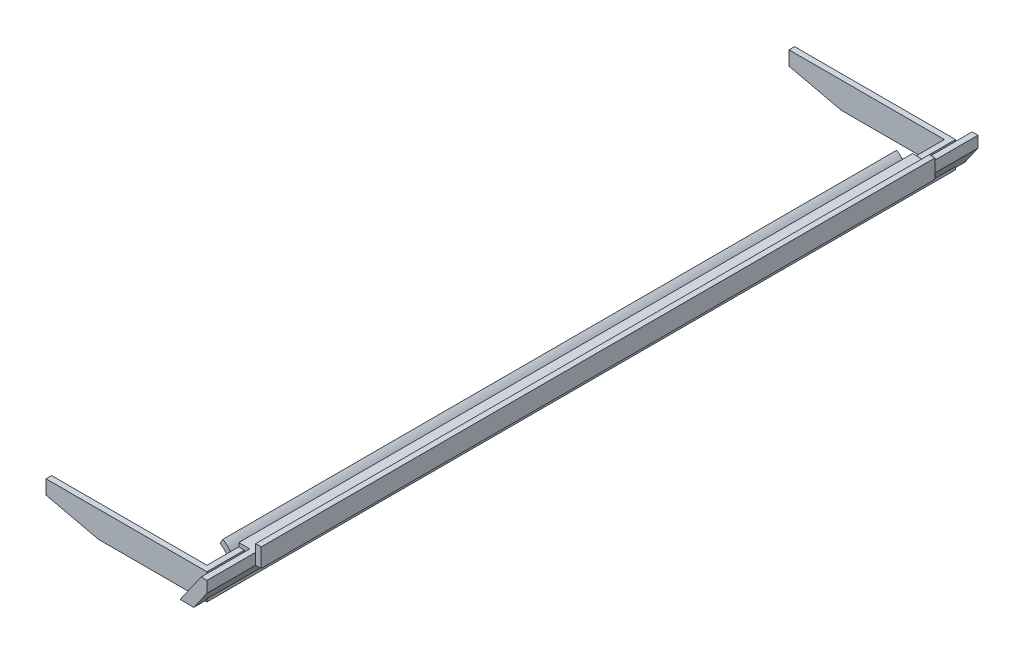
ISO-10303-21;
HEADER;
FILE_DESCRIPTION(('STEP AP214'),'2;1');
FILE_NAME('part.step','',(''),(''),'','','');
FILE_SCHEMA(('AUTOMOTIVE_DESIGN { 1 0 10303 214 1 1 1 1 }'));
ENDSEC;
DATA;
#1=APPLICATION_CONTEXT('core data for automotive mechanical design processes');
#2=APPLICATION_PROTOCOL_DEFINITION('international standard','automotive_design',2000,#1);
#3=PRODUCT_CONTEXT('',#1,'mechanical');
#4=PRODUCT('Part','Part','',(#3));
#5=PRODUCT_RELATED_PRODUCT_CATEGORY('part','',(#4));
#6=PRODUCT_DEFINITION_FORMATION('','',#4);
#7=PRODUCT_DEFINITION_CONTEXT('part definition',#1,'design');
#8=PRODUCT_DEFINITION('design','',#6,#7);
#9=PRODUCT_DEFINITION_SHAPE('','',#8);
#10=(LENGTH_UNIT() NAMED_UNIT(*) SI_UNIT(.MILLI.,.METRE.));
#11=(NAMED_UNIT(*) PLANE_ANGLE_UNIT() SI_UNIT($,.RADIAN.));
#12=(NAMED_UNIT(*) SI_UNIT($,.STERADIAN.) SOLID_ANGLE_UNIT());
#13=UNCERTAINTY_MEASURE_WITH_UNIT(LENGTH_MEASURE(1.E-05),#10,'distance_accuracy_value','');
#14=(GEOMETRIC_REPRESENTATION_CONTEXT(3) GLOBAL_UNCERTAINTY_ASSIGNED_CONTEXT((#13)) GLOBAL_UNIT_ASSIGNED_CONTEXT((#10,
#11,#12)) REPRESENTATION_CONTEXT('',''));
#15=CARTESIAN_POINT('',(0.,0.,0.));
#16=DIRECTION('',(0.,0.,1.));
#17=DIRECTION('',(1.,0.,0.));
#18=AXIS2_PLACEMENT_3D('',#15,#16,#17);
#19=CARTESIAN_POINT('',(-7.5,-4.,-90.));
#20=DIRECTION('',(0.,0.,1.));
#21=DIRECTION('',(1.,0.,0.));
#22=AXIS2_PLACEMENT_3D('',#19,#20,#21);
#23=PLANE('',#22);
#24=DIRECTION('',(-1.,0.,0.));
#25=VECTOR('',#24,1.);
#26=CARTESIAN_POINT('',(4.5,3.,-90.));
#27=LINE('',#26,#25);
#28=CARTESIAN_POINT('',(2.93829884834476,3.,-90.));
#29=VERTEX_POINT('',#28);
#30=CARTESIAN_POINT('',(0.,3.,-90.));
#31=VERTEX_POINT('',#30);
#32=EDGE_CURVE('E359',#29,#31,#27,.T.);
#33=ORIENTED_EDGE('',*,*,#32,.F.);
#34=DIRECTION('',(-0.573576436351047,-0.819152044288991,0.));
#35=VECTOR('',#34,1.);
#36=CARTESIAN_POINT('',(-3.7847205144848,-6.60146670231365,-90.));
#37=LINE('',#36,#35);
#38=CARTESIAN_POINT('',(1.5,0.945896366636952,-90.));
#39=VERTEX_POINT('',#38);
#40=EDGE_CURVE('E332',#29,#39,#37,.T.);
#41=ORIENTED_EDGE('',*,*,#40,.T.);
#42=DIRECTION('',(0.,-1.,0.));
#43=VECTOR('',#42,1.);
#44=CARTESIAN_POINT('',(1.5,2.,-90.));
#45=LINE('',#44,#43);
#46=CARTESIAN_POINT('',(1.5,2.,-90.));
#47=VERTEX_POINT('',#46);
#48=EDGE_CURVE('E599',#47,#39,#45,.T.);
#49=ORIENTED_EDGE('',*,*,#48,.F.);
#50=DIRECTION('',(-1.,0.,0.));
#51=VECTOR('',#50,1.);
#52=CARTESIAN_POINT('',(1.5,2.,-90.));
#53=LINE('',#52,#51);
#54=CARTESIAN_POINT('',(0.,2.,-90.));
#55=VERTEX_POINT('',#54);
#56=EDGE_CURVE('E306',#47,#55,#53,.T.);
#57=ORIENTED_EDGE('',*,*,#56,.T.);
#58=DIRECTION('',(0.,-1.,0.));
#59=VECTOR('',#58,1.);
#60=CARTESIAN_POINT('',(0.,0.,-90.));
#61=LINE('',#60,#59);
#62=EDGE_CURVE('E369',#31,#55,#61,.T.);
#63=ORIENTED_EDGE('',*,*,#62,.F.);
#64=EDGE_LOOP('',(#33,#41,#49,#57,#63));
#65=FACE_BOUND('',#64,.T.);
#66=ADVANCED_FACE('F31',(#65),#23,.F.);
#67=CARTESIAN_POINT('',(1.5,0.,90.));
#68=DIRECTION('',(-1.,0.,0.));
#69=DIRECTION('',(0.,-1.,0.));
#70=AXIS2_PLACEMENT_3D('',#67,#68,#69);
#71=PLANE('',#70);
#72=ORIENTED_EDGE('',*,*,#48,.T.);
#73=DIRECTION('',(0.,0.,-1.));
#74=VECTOR('',#73,1.);
#75=CARTESIAN_POINT('',(1.5,0.945896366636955,97.8780152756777));
#76=LINE('',#75,#74);
#77=CARTESIAN_POINT('',(1.5,0.945896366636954,-100.));
#78=VERTEX_POINT('',#77);
#79=EDGE_CURVE('E375',#39,#78,#76,.T.);
#80=ORIENTED_EDGE('',*,*,#79,.T.);
#81=DIRECTION('',(0.,-1.,0.));
#82=VECTOR('',#81,1.);
#83=CARTESIAN_POINT('',(1.5,2.,-100.));
#84=LINE('',#83,#82);
#85=CARTESIAN_POINT('',(1.5,2.,-100.));
#86=VERTEX_POINT('',#85);
#87=EDGE_CURVE('E603',#86,#78,#84,.T.);
#88=ORIENTED_EDGE('',*,*,#87,.F.);
#89=DIRECTION('',(0.,0.,-1.));
#90=VECTOR('',#89,1.);
#91=CARTESIAN_POINT('',(1.5,2.,-90.));
#92=LINE('',#91,#90);
#93=EDGE_CURVE('E304',#47,#86,#92,.T.);
#94=ORIENTED_EDGE('',*,*,#93,.F.);
#95=EDGE_LOOP('',(#72,#80,#88,#94));
#96=FACE_BOUND('',#95,.T.);
#97=ADVANCED_FACE('F709',(#96),#71,.F.);
#98=CARTESIAN_POINT('',(1.5,2.,-100.));
#99=DIRECTION('',(0.,0.,1.));
#100=DIRECTION('',(1.,0.,0.));
#101=AXIS2_PLACEMENT_3D('',#98,#99,#100);
#102=PLANE('',#101);
#103=DIRECTION('',(-1.,0.,0.));
#104=VECTOR('',#103,1.);
#105=CARTESIAN_POINT('',(1.5,-5.,-100.));
#106=LINE('',#105,#104);
#107=CARTESIAN_POINT('',(-2.66336145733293,-5.,-100.));
#108=VERTEX_POINT('',#107);
#109=CARTESIAN_POINT('',(-27.4999999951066,-5.,-100.));
#110=VERTEX_POINT('',#109);
#111=EDGE_CURVE('E274',#108,#110,#106,.T.);
#112=ORIENTED_EDGE('',*,*,#111,.T.);
#113=DIRECTION('',(0.974370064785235,-0.224951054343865,0.));
#114=VECTOR('',#113,1.);
#115=CARTESIAN_POINT('',(-27.4999999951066,-5.,-100.));
#116=LINE('',#115,#114);
#117=CARTESIAN_POINT('',(-41.5,-1.76784532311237,-100.));
#118=VERTEX_POINT('',#117);
#119=EDGE_CURVE('E261',#118,#110,#116,.T.);
#120=ORIENTED_EDGE('',*,*,#119,.F.);
#121=DIRECTION('',(0.,-1.,0.));
#122=VECTOR('',#121,1.);
#123=CARTESIAN_POINT('',(-41.5,2.,-100.));
#124=LINE('',#123,#122);
#125=CARTESIAN_POINT('',(-41.5,2.,-100.));
#126=VERTEX_POINT('',#125);
#127=EDGE_CURVE('E596',#126,#118,#124,.T.);
#128=ORIENTED_EDGE('',*,*,#127,.F.);
#129=DIRECTION('',(-1.,0.,0.));
#130=VECTOR('',#129,1.);
#131=CARTESIAN_POINT('',(1.5,2.,-100.));
#132=LINE('',#131,#130);
#133=EDGE_CURVE('E302',#86,#126,#132,.T.);
#134=ORIENTED_EDGE('',*,*,#133,.F.);
#135=ORIENTED_EDGE('',*,*,#87,.T.);
#136=DIRECTION('',(-0.573576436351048,-0.819152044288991,0.));
#137=VECTOR('',#136,1.);
#138=CARTESIAN_POINT('',(2.93829884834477,3.,-100.));
#139=LINE('',#138,#137);
#140=EDGE_CURVE('E39',#78,#108,#139,.T.);
#141=ORIENTED_EDGE('',*,*,#140,.T.);
#142=EDGE_LOOP('',(#112,#120,#128,#134,#135,#141));
#143=FACE_BOUND('',#142,.T.);
#144=ADVANCED_FACE('F281',(#143),#102,.F.);
#145=DIRECTION('',(1.,0.,0.));
#146=VECTOR('',#145,1.);
#147=CARTESIAN_POINT('',(6.,0.,-90.));
#148=LINE('',#147,#146);
#149=CARTESIAN_POINT('',(4.5,0.,-90.));
#150=VERTEX_POINT('',#149);
#151=CARTESIAN_POINT('',(6.,0.,-90.));
#152=VERTEX_POINT('',#151);
#153=EDGE_CURVE('E318',#150,#152,#148,.T.);
#154=ORIENTED_EDGE('',*,*,#153,.F.);
#155=DIRECTION('',(0.,1.,0.));
#156=VECTOR('',#155,1.);
#157=CARTESIAN_POINT('',(4.5,-4.,-90.));
#158=LINE('',#157,#156);
#159=CARTESIAN_POINT('',(4.5,3.,-90.));
#160=VERTEX_POINT('',#159);
#161=EDGE_CURVE('E376',#150,#160,#158,.T.);
#162=ORIENTED_EDGE('',*,*,#161,.T.);
#163=DIRECTION('',(0.,-1.,0.));
#164=VECTOR('',#163,1.);
#165=CARTESIAN_POINT('',(4.5,3.,-90.));
#166=LINE('',#165,#164);
#167=CARTESIAN_POINT('',(4.5,5.,-90.));
#168=VERTEX_POINT('',#167);
#169=EDGE_CURVE('E371',#168,#160,#166,.T.);
#170=ORIENTED_EDGE('',*,*,#169,.F.);
#171=DIRECTION('',(-1.,0.,0.));
#172=VECTOR('',#171,1.);
#173=CARTESIAN_POINT('',(4.5,5.,-90.));
#174=LINE('',#173,#172);
#175=CARTESIAN_POINT('',(6.,5.,-90.));
#176=VERTEX_POINT('',#175);
#177=EDGE_CURVE('E652',#176,#168,#174,.T.);
#178=ORIENTED_EDGE('',*,*,#177,.F.);
#179=DIRECTION('',(0.,1.,0.));
#180=VECTOR('',#179,1.);
#181=CARTESIAN_POINT('',(6.,0.,-90.));
#182=LINE('',#181,#180);
#183=EDGE_CURVE('E320',#152,#176,#182,.T.);
#184=ORIENTED_EDGE('',*,*,#183,.F.);
#185=EDGE_LOOP('',(#154,#162,#170,#178,#184));
#186=FACE_BOUND('',#185,.T.);
#187=ADVANCED_FACE('F695',(#186),#23,.F.);
#188=DIRECTION('',(0.,0.,1.));
#189=VECTOR('',#188,1.);
#190=CARTESIAN_POINT('',(1.5,0.945896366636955,82.1219847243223));
#191=LINE('',#190,#189);
#192=CARTESIAN_POINT('',(1.5,0.945896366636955,90.));
#193=VERTEX_POINT('',#192);
#194=CARTESIAN_POINT('',(1.5,0.945896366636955,100.));
#195=VERTEX_POINT('',#194);
#196=EDGE_CURVE('E594',#193,#195,#191,.T.);
#197=ORIENTED_EDGE('',*,*,#196,.F.);
#198=DIRECTION('',(0.,-1.,0.));
#199=VECTOR('',#198,1.);
#200=CARTESIAN_POINT('',(1.5,2.,90.));
#201=LINE('',#200,#199);
#202=CARTESIAN_POINT('',(1.5,2.,90.));
#203=VERTEX_POINT('',#202);
#204=EDGE_CURVE('E639',#203,#193,#201,.T.);
#205=ORIENTED_EDGE('',*,*,#204,.F.);
#206=DIRECTION('',(0.,0.,1.));
#207=VECTOR('',#206,1.);
#208=CARTESIAN_POINT('',(1.5,2.,90.));
#209=LINE('',#208,#207);
#210=CARTESIAN_POINT('',(1.5,2.,100.));
#211=VERTEX_POINT('',#210);
#212=EDGE_CURVE('E429',#203,#211,#209,.T.);
#213=ORIENTED_EDGE('',*,*,#212,.T.);
#214=DIRECTION('',(0.,-1.,0.));
#215=VECTOR('',#214,1.);
#216=CARTESIAN_POINT('',(1.5,2.,100.));
#217=LINE('',#216,#215);
#218=EDGE_CURVE('E633',#211,#195,#217,.T.);
#219=ORIENTED_EDGE('',*,*,#218,.T.);
#220=EDGE_LOOP('',(#197,#205,#213,#219));
#221=FACE_BOUND('',#220,.T.);
#222=ADVANCED_FACE('F665',(#221),#71,.F.);
#223=CARTESIAN_POINT('',(1.5,-4.28444402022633,-100.));
#224=VERTEX_POINT('',#223);
#225=CARTESIAN_POINT('',(1.5,-5.,-100.));
#226=VERTEX_POINT('',#225);
#227=EDGE_CURVE('E623',#224,#226,#84,.T.);
#228=ORIENTED_EDGE('',*,*,#227,.F.);
#229=DIRECTION('',(0.,0.,1.));
#230=VECTOR('',#229,1.);
#231=CARTESIAN_POINT('',(1.5,-4.28444402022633,82.1219847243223));
#232=LINE('',#231,#230);
#233=CARTESIAN_POINT('',(1.5,-4.28444402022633,100.));
#234=VERTEX_POINT('',#233);
#235=EDGE_CURVE('E592',#224,#234,#232,.T.);
#236=ORIENTED_EDGE('',*,*,#235,.T.);
#237=CARTESIAN_POINT('',(1.5,-5.,100.));
#238=VERTEX_POINT('',#237);
#239=EDGE_CURVE('E635',#234,#238,#217,.T.);
#240=ORIENTED_EDGE('',*,*,#239,.T.);
#241=DIRECTION('',(0.,0.,-1.));
#242=VECTOR('',#241,1.);
#243=CARTESIAN_POINT('',(1.5,-5.,90.));
#244=LINE('',#243,#242);
#245=EDGE_CURVE('E545',#238,#226,#244,.T.);
#246=ORIENTED_EDGE('',*,*,#245,.T.);
#247=EDGE_LOOP('',(#228,#236,#240,#246));
#248=FACE_BOUND('',#247,.T.);
#249=ADVANCED_FACE('F707',(#248),#71,.F.);
#250=CARTESIAN_POINT('',(-7.5,-4.,90.));
#251=DIRECTION('',(0.,0.,1.));
#252=DIRECTION('',(1.,0.,0.));
#253=AXIS2_PLACEMENT_3D('',#250,#251,#252);
#254=PLANE('',#253);
#255=DIRECTION('',(0.,-1.,0.));
#256=VECTOR('',#255,1.);
#257=CARTESIAN_POINT('',(4.5,3.,90.));
#258=LINE('',#257,#256);
#259=CARTESIAN_POINT('',(4.5,5.,90.));
#260=VERTEX_POINT('',#259);
#261=CARTESIAN_POINT('',(4.5,3.,90.));
#262=VERTEX_POINT('',#261);
#263=EDGE_CURVE('E504',#260,#262,#258,.T.);
#264=ORIENTED_EDGE('',*,*,#263,.T.);
#265=DIRECTION('',(0.,1.,0.));
#266=VECTOR('',#265,1.);
#267=CARTESIAN_POINT('',(4.5,3.,90.));
#268=LINE('',#267,#266);
#269=CARTESIAN_POINT('',(4.5,0.,90.));
#270=VERTEX_POINT('',#269);
#271=EDGE_CURVE('E454',#270,#262,#268,.T.);
#272=ORIENTED_EDGE('',*,*,#271,.F.);
#273=DIRECTION('',(1.,0.,0.));
#274=VECTOR('',#273,1.);
#275=CARTESIAN_POINT('',(6.,0.,90.));
#276=LINE('',#275,#274);
#277=CARTESIAN_POINT('',(6.,0.,90.));
#278=VERTEX_POINT('',#277);
#279=EDGE_CURVE('E472',#270,#278,#276,.T.);
#280=ORIENTED_EDGE('',*,*,#279,.T.);
#281=DIRECTION('',(0.,1.,0.));
#282=VECTOR('',#281,1.);
#283=CARTESIAN_POINT('',(6.,0.,90.));
#284=LINE('',#283,#282);
#285=CARTESIAN_POINT('',(6.,5.,90.));
#286=VERTEX_POINT('',#285);
#287=EDGE_CURVE('E475',#278,#286,#284,.T.);
#288=ORIENTED_EDGE('',*,*,#287,.T.);
#289=DIRECTION('',(-1.,0.,0.));
#290=VECTOR('',#289,1.);
#291=CARTESIAN_POINT('',(4.5,5.,90.));
#292=LINE('',#291,#290);
#293=EDGE_CURVE('E570',#286,#260,#292,.T.);
#294=ORIENTED_EDGE('',*,*,#293,.T.);
#295=EDGE_LOOP('',(#264,#272,#280,#288,#294));
#296=FACE_BOUND('',#295,.T.);
#297=ADVANCED_FACE('F576',(#296),#254,.T.);
#298=ORIENTED_EDGE('',*,*,#204,.T.);
#299=DIRECTION('',(-0.573576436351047,-0.819152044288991,0.));
#300=VECTOR('',#299,1.);
#301=CARTESIAN_POINT('',(1.5,0.945896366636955,90.));
#302=LINE('',#301,#300);
#303=CARTESIAN_POINT('',(2.93829884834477,3.,90.));
#304=VERTEX_POINT('',#303);
#305=EDGE_CURVE('E464',#304,#193,#302,.T.);
#306=ORIENTED_EDGE('',*,*,#305,.F.);
#307=DIRECTION('',(-1.,0.,0.));
#308=VECTOR('',#307,1.);
#309=CARTESIAN_POINT('',(4.5,3.,90.));
#310=LINE('',#309,#308);
#311=CARTESIAN_POINT('',(0.,3.,90.));
#312=VERTEX_POINT('',#311);
#313=EDGE_CURVE('E500',#304,#312,#310,.T.);
#314=ORIENTED_EDGE('',*,*,#313,.T.);
#315=DIRECTION('',(0.,-1.,0.));
#316=VECTOR('',#315,1.);
#317=CARTESIAN_POINT('',(0.,3.,90.));
#318=LINE('',#317,#316);
#319=CARTESIAN_POINT('',(0.,2.,90.));
#320=VERTEX_POINT('',#319);
#321=EDGE_CURVE('E494',#312,#320,#318,.T.);
#322=ORIENTED_EDGE('',*,*,#321,.T.);
#323=DIRECTION('',(-1.,0.,0.));
#324=VECTOR('',#323,1.);
#325=CARTESIAN_POINT('',(1.5,2.,90.));
#326=LINE('',#325,#324);
#327=EDGE_CURVE('E432',#203,#320,#326,.T.);
#328=ORIENTED_EDGE('',*,*,#327,.F.);
#329=EDGE_LOOP('',(#298,#306,#314,#322,#328));
#330=FACE_BOUND('',#329,.T.);
#331=ADVANCED_FACE('F660',(#330),#254,.T.);
#332=CARTESIAN_POINT('',(1.5,2.,100.));
#333=DIRECTION('',(0.,0.,1.));
#334=DIRECTION('',(1.,0.,0.));
#335=AXIS2_PLACEMENT_3D('',#332,#333,#334);
#336=PLANE('',#335);
#337=DIRECTION('',(0.573576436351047,0.819152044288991,0.));
#338=VECTOR('',#337,1.);
#339=CARTESIAN_POINT('',(4.5,0.,100.));
#340=LINE('',#339,#338);
#341=CARTESIAN_POINT('',(0.99896230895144,-5.,100.));
#342=VERTEX_POINT('',#341);
#343=EDGE_CURVE('E461',#342,#234,#340,.T.);
#344=ORIENTED_EDGE('',*,*,#343,.F.);
#345=DIRECTION('',(-1.,0.,0.));
#346=VECTOR('',#345,1.);
#347=CARTESIAN_POINT('',(1.5,-5.,100.));
#348=LINE('',#347,#346);
#349=EDGE_CURVE('E410',#238,#342,#348,.T.);
#350=ORIENTED_EDGE('',*,*,#349,.F.);
#351=ORIENTED_EDGE('',*,*,#239,.F.);
#352=EDGE_LOOP('',(#344,#350,#351));
#353=FACE_BOUND('',#352,.T.);
#354=ADVANCED_FACE('F732',(#353),#336,.T.);
#355=DIRECTION('',(0.,-1.,0.));
#356=VECTOR('',#355,1.);
#357=CARTESIAN_POINT('',(0.,2.,90.));
#358=LINE('',#357,#356);
#359=CARTESIAN_POINT('',(0.,-4.,90.));
#360=VERTEX_POINT('',#359);
#361=CARTESIAN_POINT('',(0.,-5.,90.));
#362=VERTEX_POINT('',#361);
#363=EDGE_CURVE('E448',#360,#362,#358,.T.);
#364=ORIENTED_EDGE('',*,*,#363,.F.);
#365=DIRECTION('',(-1.,0.,0.));
#366=VECTOR('',#365,1.);
#367=CARTESIAN_POINT('',(0.,-4.,90.));
#368=LINE('',#367,#366);
#369=CARTESIAN_POINT('',(-1.,-4.,90.));
#370=VERTEX_POINT('',#369);
#371=EDGE_CURVE('E492',#360,#370,#368,.T.);
#372=ORIENTED_EDGE('',*,*,#371,.T.);
#373=CARTESIAN_POINT('',(-7.5,-4.,90.));
#374=DIRECTION('',(0.,0.,1.));
#375=DIRECTION('',(-1.,0.,0.));
#376=AXIS2_PLACEMENT_3D('',#373,#374,#375);
#377=CIRCLE('',#376,6.5);
#378=CARTESIAN_POINT('',(-4.25000000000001,1.62916512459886,90.));
#379=VERTEX_POINT('',#378);
#380=EDGE_CURVE('E493',#370,#379,#377,.T.);
#381=ORIENTED_EDGE('',*,*,#380,.T.);
#382=DIRECTION('',(-0.499999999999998,-0.86602540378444,0.));
#383=VECTOR('',#382,1.);
#384=CARTESIAN_POINT('',(-5.00000000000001,0.330127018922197,90.));
#385=LINE('',#384,#383);
#386=CARTESIAN_POINT('',(-5.00000000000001,0.330127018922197,90.));
#387=VERTEX_POINT('',#386);
#388=EDGE_CURVE('E498',#379,#387,#385,.T.);
#389=ORIENTED_EDGE('',*,*,#388,.T.);
#390=CARTESIAN_POINT('',(-7.5,-4.,90.));
#391=DIRECTION('',(0.,0.,-1.));
#392=DIRECTION('',(1.,0.,0.));
#393=AXIS2_PLACEMENT_3D('',#390,#391,#392);
#394=CIRCLE('',#393,5.);
#395=CARTESIAN_POINT('',(-2.5,-4.,90.));
#396=VERTEX_POINT('',#395);
#397=EDGE_CURVE('E515',#387,#396,#394,.T.);
#398=ORIENTED_EDGE('',*,*,#397,.T.);
#399=DIRECTION('',(0.,-1.,0.));
#400=VECTOR('',#399,1.);
#401=CARTESIAN_POINT('',(-2.5,-4.,90.));
#402=LINE('',#401,#400);
#403=CARTESIAN_POINT('',(-2.5,-5.,90.));
#404=VERTEX_POINT('',#403);
#405=EDGE_CURVE('E517',#396,#404,#402,.T.);
#406=ORIENTED_EDGE('',*,*,#405,.T.);
#407=DIRECTION('',(1.,0.,0.));
#408=VECTOR('',#407,1.);
#409=CARTESIAN_POINT('',(1.5,-5.,90.));
#410=LINE('',#409,#408);
#411=EDGE_CURVE('E476',#404,#362,#410,.T.);
#412=ORIENTED_EDGE('',*,*,#411,.T.);
#413=EDGE_LOOP('',(#364,#372,#381,#389,#398,#406,#412));
#414=FACE_BOUND('',#413,.T.);
#415=ADVANCED_FACE('F715',(#414),#254,.T.);
#416=CARTESIAN_POINT('',(1.5,-5.,90.));
#417=DIRECTION('',(0.,1.,0.));
#418=DIRECTION('',(-1.,0.,0.));
#419=AXIS2_PLACEMENT_3D('',#416,#417,#418);
#420=PLANE('',#419);
#421=CARTESIAN_POINT('',(-2.66336145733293,-5.,100.));
#422=VERTEX_POINT('',#421);
#423=CARTESIAN_POINT('',(-27.4999999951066,-5.,100.));
#424=VERTEX_POINT('',#423);
#425=EDGE_CURVE('E400',#422,#424,#348,.T.);
#426=ORIENTED_EDGE('',*,*,#425,.T.);
#427=DIRECTION('',(0.,0.,-1.));
#428=VECTOR('',#427,1.);
#429=CARTESIAN_POINT('',(-27.4999999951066,-5.,103.000025));
#430=LINE('',#429,#428);
#431=CARTESIAN_POINT('',(-27.4999999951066,-5.,98.5));
#432=VERTEX_POINT('',#431);
#433=EDGE_CURVE('E278',#424,#432,#430,.T.);
#434=ORIENTED_EDGE('',*,*,#433,.T.);
#435=DIRECTION('',(1.,0.,0.));
#436=VECTOR('',#435,1.);
#437=CARTESIAN_POINT('',(1.5,-5.,98.5));
#438=LINE('',#437,#436);
#439=CARTESIAN_POINT('',(0.,-5.,98.5));
#440=VERTEX_POINT('',#439);
#441=EDGE_CURVE('E398',#440,#432,#438,.F.);
#442=ORIENTED_EDGE('',*,*,#441,.F.);
#443=DIRECTION('',(0.,0.,1.));
#444=VECTOR('',#443,1.);
#445=CARTESIAN_POINT('',(0.,-5.,90.));
#446=LINE('',#445,#444);
#447=EDGE_CURVE('E409',#362,#440,#446,.T.);
#448=ORIENTED_EDGE('',*,*,#447,.F.);
#449=ORIENTED_EDGE('',*,*,#411,.F.);
#450=DIRECTION('',(0.,0.,-1.));
#451=VECTOR('',#450,1.);
#452=CARTESIAN_POINT('',(-2.5,-5.,90.));
#453=LINE('',#452,#451);
#454=CARTESIAN_POINT('',(-2.5,-5.,-90.));
#455=VERTEX_POINT('',#454);
#456=EDGE_CURVE('E519',#404,#455,#453,.T.);
#457=ORIENTED_EDGE('',*,*,#456,.T.);
#458=DIRECTION('',(1.,0.,0.));
#459=VECTOR('',#458,1.);
#460=CARTESIAN_POINT('',(1.5,-5.,-90.));
#461=LINE('',#460,#459);
#462=CARTESIAN_POINT('',(0.,-5.,-90.));
#463=VERTEX_POINT('',#462);
#464=EDGE_CURVE('E321',#455,#463,#461,.T.);
#465=ORIENTED_EDGE('',*,*,#464,.T.);
#466=DIRECTION('',(0.,0.,-1.));
#467=VECTOR('',#466,1.);
#468=CARTESIAN_POINT('',(0.,-5.,-90.));
#469=LINE('',#468,#467);
#470=CARTESIAN_POINT('',(0.,-5.,-98.5));
#471=VERTEX_POINT('',#470);
#472=EDGE_CURVE('E288',#463,#471,#469,.T.);
#473=ORIENTED_EDGE('',*,*,#472,.T.);
#474=DIRECTION('',(1.,0.,0.));
#475=VECTOR('',#474,1.);
#476=CARTESIAN_POINT('',(1.5,-5.,-98.5));
#477=LINE('',#476,#475);
#478=CARTESIAN_POINT('',(-27.4999999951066,-5.,-98.5));
#479=VERTEX_POINT('',#478);
#480=EDGE_CURVE('E277',#471,#479,#477,.F.);
#481=ORIENTED_EDGE('',*,*,#480,.T.);
#482=EDGE_CURVE('E53',#479,#110,#430,.T.);
#483=ORIENTED_EDGE('',*,*,#482,.T.);
#484=ORIENTED_EDGE('',*,*,#111,.F.);
#485=DIRECTION('',(0.,0.,1.));
#486=VECTOR('',#485,1.);
#487=CARTESIAN_POINT('',(-2.66336145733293,-5.,-103.));
#488=LINE('',#487,#486);
#489=CARTESIAN_POINT('',(-2.66336145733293,-5.,-103.));
#490=VERTEX_POINT('',#489);
#491=EDGE_CURVE('E324',#490,#108,#488,.T.);
#492=ORIENTED_EDGE('',*,*,#491,.F.);
#493=DIRECTION('',(1.,0.,0.));
#494=VECTOR('',#493,1.);
#495=CARTESIAN_POINT('',(-2.66336145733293,-5.,-103.));
#496=LINE('',#495,#494);
#497=CARTESIAN_POINT('',(0.998962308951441,-5.,-103.));
#498=VERTEX_POINT('',#497);
#499=EDGE_CURVE('E344',#490,#498,#496,.T.);
#500=ORIENTED_EDGE('',*,*,#499,.T.);
#501=DIRECTION('',(0.,0.,1.));
#502=VECTOR('',#501,1.);
#503=CARTESIAN_POINT('',(0.998962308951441,-5.,-103.));
#504=LINE('',#503,#502);
#505=CARTESIAN_POINT('',(0.998962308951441,-5.,-100.));
#506=VERTEX_POINT('',#505);
#507=EDGE_CURVE('E290',#498,#506,#504,.T.);
#508=ORIENTED_EDGE('',*,*,#507,.T.);
#509=EDGE_CURVE('E284',#226,#506,#106,.T.);
#510=ORIENTED_EDGE('',*,*,#509,.F.);
#511=ORIENTED_EDGE('',*,*,#245,.F.);
#512=ORIENTED_EDGE('',*,*,#349,.T.);
#513=DIRECTION('',(0.,0.,-1.));
#514=VECTOR('',#513,1.);
#515=CARTESIAN_POINT('',(0.998962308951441,-5.,103.));
#516=LINE('',#515,#514);
#517=CARTESIAN_POINT('',(0.998962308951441,-5.,103.));
#518=VERTEX_POINT('',#517);
#519=EDGE_CURVE('E466',#518,#342,#516,.T.);
#520=ORIENTED_EDGE('',*,*,#519,.F.);
#521=DIRECTION('',(1.,0.,0.));
#522=VECTOR('',#521,1.);
#523=CARTESIAN_POINT('',(-2.66336145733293,-5.,103.));
#524=LINE('',#523,#522);
#525=CARTESIAN_POINT('',(-2.66336145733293,-5.,103.));
#526=VERTEX_POINT('',#525);
#527=EDGE_CURVE('E677',#526,#518,#524,.T.);
#528=ORIENTED_EDGE('',*,*,#527,.F.);
#529=DIRECTION('',(0.,0.,-1.));
#530=VECTOR('',#529,1.);
#531=CARTESIAN_POINT('',(-2.66336145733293,-5.,103.));
#532=LINE('',#531,#530);
#533=EDGE_CURVE('E449',#526,#422,#532,.T.);
#534=ORIENTED_EDGE('',*,*,#533,.T.);
#535=EDGE_LOOP('',(#426,#434,#442,#448,#449,#457,#465,#473,#481,#483,#484,#492,#500,#508,#510,
#511,#512,#520,#528,#534));
#536=FACE_BOUND('',#535,.T.);
#537=ADVANCED_FACE('F33',(#536),#420,.F.);
#538=CARTESIAN_POINT('',(6.,0.,90.));
#539=DIRECTION('',(0.,1.,0.));
#540=DIRECTION('',(-1.,0.,0.));
#541=AXIS2_PLACEMENT_3D('',#538,#539,#540);
#542=PLANE('',#541);
#543=ORIENTED_EDGE('',*,*,#279,.F.);
#544=DIRECTION('',(0.,0.,-1.));
#545=VECTOR('',#544,1.);
#546=CARTESIAN_POINT('',(4.5,0.,97.8780152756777));
#547=LINE('',#546,#545);
#548=EDGE_CURVE('E378',#270,#150,#547,.T.);
#549=ORIENTED_EDGE('',*,*,#548,.T.);
#550=ORIENTED_EDGE('',*,*,#153,.T.);
#551=DIRECTION('',(0.,0.,-1.));
#552=VECTOR('',#551,1.);
#553=CARTESIAN_POINT('',(6.,0.,90.));
#554=LINE('',#553,#552);
#555=EDGE_CURVE('E543',#278,#152,#554,.T.);
#556=ORIENTED_EDGE('',*,*,#555,.F.);
#557=EDGE_LOOP('',(#543,#549,#550,#556));
#558=FACE_BOUND('',#557,.T.);
#559=ADVANCED_FACE('F692',(#558),#542,.F.);
#560=CARTESIAN_POINT('',(6.,0.,90.));
#561=DIRECTION('',(-1.,0.,0.));
#562=DIRECTION('',(0.,0.,1.));
#563=AXIS2_PLACEMENT_3D('',#560,#561,#562);
#564=PLANE('',#563);
#565=ORIENTED_EDGE('',*,*,#183,.T.);
#566=DIRECTION('',(0.,0.,-1.));
#567=VECTOR('',#566,1.);
#568=CARTESIAN_POINT('',(6.,5.,90.));
#569=LINE('',#568,#567);
#570=EDGE_CURVE('E540',#286,#176,#569,.T.);
#571=ORIENTED_EDGE('',*,*,#570,.F.);
#572=ORIENTED_EDGE('',*,*,#287,.F.);
#573=ORIENTED_EDGE('',*,*,#555,.T.);
#574=EDGE_LOOP('',(#565,#571,#572,#573));
#575=FACE_BOUND('',#574,.T.);
#576=ADVANCED_FACE('F773',(#575),#564,.F.);
#577=CARTESIAN_POINT('',(4.5,5.,90.));
#578=DIRECTION('',(0.,-1.,0.));
#579=DIRECTION('',(1.,0.,0.));
#580=AXIS2_PLACEMENT_3D('',#577,#578,#579);
#581=PLANE('',#580);
#582=ORIENTED_EDGE('',*,*,#177,.T.);
#583=DIRECTION('',(0.,0.,-1.));
#584=VECTOR('',#583,1.);
#585=CARTESIAN_POINT('',(4.5,5.,90.));
#586=LINE('',#585,#584);
#587=EDGE_CURVE('E537',#260,#168,#586,.T.);
#588=ORIENTED_EDGE('',*,*,#587,.F.);
#589=ORIENTED_EDGE('',*,*,#293,.F.);
#590=ORIENTED_EDGE('',*,*,#570,.T.);
#591=EDGE_LOOP('',(#582,#588,#589,#590));
#592=FACE_BOUND('',#591,.T.);
#593=ADVANCED_FACE('F770',(#592),#581,.F.);
#594=CARTESIAN_POINT('',(4.5,3.,90.));
#595=DIRECTION('',(1.,0.,0.));
#596=DIRECTION('',(0.,0.,-1.));
#597=AXIS2_PLACEMENT_3D('',#594,#595,#596);
#598=PLANE('',#597);
#599=ORIENTED_EDGE('',*,*,#169,.T.);
#600=DIRECTION('',(0.,0.,-1.));
#601=VECTOR('',#600,1.);
#602=CARTESIAN_POINT('',(4.5,3.,90.));
#603=LINE('',#602,#601);
#604=EDGE_CURVE('E534',#262,#160,#603,.T.);
#605=ORIENTED_EDGE('',*,*,#604,.F.);
#606=ORIENTED_EDGE('',*,*,#263,.F.);
#607=ORIENTED_EDGE('',*,*,#587,.T.);
#608=EDGE_LOOP('',(#599,#605,#606,#607));
#609=FACE_BOUND('',#608,.T.);
#610=ADVANCED_FACE('F582',(#609),#598,.F.);
#611=CARTESIAN_POINT('',(4.5,3.,90.));
#612=DIRECTION('',(0.,-1.,0.));
#613=DIRECTION('',(1.,0.,0.));
#614=AXIS2_PLACEMENT_3D('',#611,#612,#613);
#615=PLANE('',#614);
#616=ORIENTED_EDGE('',*,*,#313,.F.);
#617=DIRECTION('',(0.,0.,-1.));
#618=VECTOR('',#617,1.);
#619=CARTESIAN_POINT('',(2.93829884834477,3.,103.));
#620=LINE('',#619,#618);
#621=CARTESIAN_POINT('',(2.93829884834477,3.,103.));
#622=VERTEX_POINT('',#621);
#623=EDGE_CURVE('E589',#622,#304,#620,.T.);
#624=ORIENTED_EDGE('',*,*,#623,.F.);
#625=DIRECTION('',(-1.,0.,0.));
#626=VECTOR('',#625,1.);
#627=CARTESIAN_POINT('',(4.5,3.,103.));
#628=LINE('',#627,#626);
#629=CARTESIAN_POINT('',(4.5,3.,103.));
#630=VERTEX_POINT('',#629);
#631=EDGE_CURVE('E585',#630,#622,#628,.T.);
#632=ORIENTED_EDGE('',*,*,#631,.F.);
#633=DIRECTION('',(0.,0.,-1.));
#634=VECTOR('',#633,1.);
#635=CARTESIAN_POINT('',(4.5,3.,103.));
#636=LINE('',#635,#634);
#637=EDGE_CURVE('E442',#630,#262,#636,.T.);
#638=ORIENTED_EDGE('',*,*,#637,.T.);
#639=ORIENTED_EDGE('',*,*,#604,.T.);
#640=DIRECTION('',(0.,0.,1.));
#641=VECTOR('',#640,1.);
#642=CARTESIAN_POINT('',(4.5,3.,-103.));
#643=LINE('',#642,#641);
#644=CARTESIAN_POINT('',(4.5,3.,-103.));
#645=VERTEX_POINT('',#644);
#646=EDGE_CURVE('E353',#645,#160,#643,.T.);
#647=ORIENTED_EDGE('',*,*,#646,.F.);
#648=DIRECTION('',(-1.,0.,0.));
#649=VECTOR('',#648,1.);
#650=CARTESIAN_POINT('',(4.5,3.,-103.));
#651=LINE('',#650,#649);
#652=CARTESIAN_POINT('',(2.93829884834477,3.,-103.));
#653=VERTEX_POINT('',#652);
#654=EDGE_CURVE('E350',#645,#653,#651,.T.);
#655=ORIENTED_EDGE('',*,*,#654,.T.);
#656=DIRECTION('',(0.,0.,1.));
#657=VECTOR('',#656,1.);
#658=CARTESIAN_POINT('',(2.93829884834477,3.,-103.));
#659=LINE('',#658,#657);
#660=EDGE_CURVE('E326',#653,#29,#659,.T.);
#661=ORIENTED_EDGE('',*,*,#660,.T.);
#662=ORIENTED_EDGE('',*,*,#32,.T.);
#663=DIRECTION('',(0.,0.,-1.));
#664=VECTOR('',#663,1.);
#665=CARTESIAN_POINT('',(0.,3.,90.));
#666=LINE('',#665,#664);
#667=EDGE_CURVE('E489',#312,#31,#666,.T.);
#668=ORIENTED_EDGE('',*,*,#667,.F.);
#669=EDGE_LOOP('',(#616,#624,#632,#638,#639,#647,#655,#661,#662,#668));
#670=FACE_BOUND('',#669,.T.);
#671=ADVANCED_FACE('F357',(#670),#615,.F.);
#672=CARTESIAN_POINT('',(0.,0.,90.));
#673=DIRECTION('',(1.,0.,0.));
#674=DIRECTION('',(0.,1.,0.));
#675=AXIS2_PLACEMENT_3D('',#672,#673,#674);
#676=PLANE('',#675);
#677=ORIENTED_EDGE('',*,*,#62,.T.);
#678=DIRECTION('',(0.,0.,-1.));
#679=VECTOR('',#678,1.);
#680=CARTESIAN_POINT('',(0.,2.,-90.));
#681=LINE('',#680,#679);
#682=CARTESIAN_POINT('',(0.,2.,-98.5));
#683=VERTEX_POINT('',#682);
#684=EDGE_CURVE('E314',#55,#683,#681,.T.);
#685=ORIENTED_EDGE('',*,*,#684,.T.);
#686=DIRECTION('',(0.,-1.,0.));
#687=VECTOR('',#686,1.);
#688=CARTESIAN_POINT('',(0.,2.,-98.5));
#689=LINE('',#688,#687);
#690=EDGE_CURVE('E602',#683,#471,#689,.T.);
#691=ORIENTED_EDGE('',*,*,#690,.T.);
#692=ORIENTED_EDGE('',*,*,#472,.F.);
#693=DIRECTION('',(0.,-1.,0.));
#694=VECTOR('',#693,1.);
#695=CARTESIAN_POINT('',(0.,2.,-90.));
#696=LINE('',#695,#694);
#697=CARTESIAN_POINT('',(0.,-4.,-90.));
#698=VERTEX_POINT('',#697);
#699=EDGE_CURVE('E447',#698,#463,#696,.T.);
#700=ORIENTED_EDGE('',*,*,#699,.F.);
#701=DIRECTION('',(0.,0.,-1.));
#702=VECTOR('',#701,1.);
#703=CARTESIAN_POINT('',(0.,-4.,90.));
#704=LINE('',#703,#702);
#705=EDGE_CURVE('E486',#360,#698,#704,.T.);
#706=ORIENTED_EDGE('',*,*,#705,.F.);
#707=ORIENTED_EDGE('',*,*,#363,.T.);
#708=ORIENTED_EDGE('',*,*,#447,.T.);
#709=DIRECTION('',(0.,-1.,0.));
#710=VECTOR('',#709,1.);
#711=CARTESIAN_POINT('',(0.,2.,98.5));
#712=LINE('',#711,#710);
#713=CARTESIAN_POINT('',(0.,2.,98.5));
#714=VERTEX_POINT('',#713);
#715=EDGE_CURVE('E408',#714,#440,#712,.T.);
#716=ORIENTED_EDGE('',*,*,#715,.F.);
#717=DIRECTION('',(0.,0.,1.));
#718=VECTOR('',#717,1.);
#719=CARTESIAN_POINT('',(0.,2.,90.));
#720=LINE('',#719,#718);
#721=EDGE_CURVE('E426',#320,#714,#720,.T.);
#722=ORIENTED_EDGE('',*,*,#721,.F.);
#723=ORIENTED_EDGE('',*,*,#321,.F.);
#724=ORIENTED_EDGE('',*,*,#667,.T.);
#725=EDGE_LOOP('',(#677,#685,#691,#692,#700,#706,#707,#708,#716,#722,#723,#724));
#726=FACE_BOUND('',#725,.T.);
#727=ADVANCED_FACE('F554',(#726),#676,.F.);
#728=CARTESIAN_POINT('',(0.,-4.,90.));
#729=DIRECTION('',(0.,-1.,0.));
#730=DIRECTION('',(1.,0.,0.));
#731=AXIS2_PLACEMENT_3D('',#728,#729,#730);
#732=PLANE('',#731);
#733=DIRECTION('',(-1.,0.,0.));
#734=VECTOR('',#733,1.);
#735=CARTESIAN_POINT('',(0.,-4.,-90.));
#736=LINE('',#735,#734);
#737=CARTESIAN_POINT('',(-1.,-4.,-90.));
#738=VERTEX_POINT('',#737);
#739=EDGE_CURVE('E611',#698,#738,#736,.T.);
#740=ORIENTED_EDGE('',*,*,#739,.T.);
#741=DIRECTION('',(0.,0.,-1.));
#742=VECTOR('',#741,1.);
#743=CARTESIAN_POINT('',(-1.,-4.,90.));
#744=LINE('',#743,#742);
#745=EDGE_CURVE('E490',#370,#738,#744,.T.);
#746=ORIENTED_EDGE('',*,*,#745,.F.);
#747=ORIENTED_EDGE('',*,*,#371,.F.);
#748=ORIENTED_EDGE('',*,*,#705,.T.);
#749=EDGE_LOOP('',(#740,#746,#747,#748));
#750=FACE_BOUND('',#749,.T.);
#751=ADVANCED_FACE('F739',(#750),#732,.F.);
#752=CARTESIAN_POINT('',(-7.5,-4.,90.));
#753=DIRECTION('',(0.,0.,-1.));
#754=DIRECTION('',(-1.,0.,0.));
#755=AXIS2_PLACEMENT_3D('',#752,#753,#754);
#756=CYLINDRICAL_SURFACE('',#755,6.5);
#757=CARTESIAN_POINT('',(-7.5,-4.,-90.));
#758=DIRECTION('',(0.,0.,1.));
#759=DIRECTION('',(-1.,0.,0.));
#760=AXIS2_PLACEMENT_3D('',#757,#758,#759);
#761=CIRCLE('',#760,6.5);
#762=CARTESIAN_POINT('',(-4.25000000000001,1.62916512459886,-90.));
#763=VERTEX_POINT('',#762);
#764=EDGE_CURVE('E613',#738,#763,#761,.T.);
#765=ORIENTED_EDGE('',*,*,#764,.T.);
#766=DIRECTION('',(0.,0.,-1.));
#767=VECTOR('',#766,1.);
#768=CARTESIAN_POINT('',(-4.25000000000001,1.62916512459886,90.));
#769=LINE('',#768,#767);
#770=EDGE_CURVE('E528',#379,#763,#769,.T.);
#771=ORIENTED_EDGE('',*,*,#770,.F.);
#772=ORIENTED_EDGE('',*,*,#380,.F.);
#773=ORIENTED_EDGE('',*,*,#745,.T.);
#774=EDGE_LOOP('',(#765,#771,#772,#773));
#775=FACE_BOUND('',#774,.T.);
#776=ADVANCED_FACE('F742',(#775),#756,.T.);
#777=CARTESIAN_POINT('',(-5.00000000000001,0.330127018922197,90.));
#778=DIRECTION('',(0.86602540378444,-0.499999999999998,0.));
#779=DIRECTION('',(0.499999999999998,0.86602540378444,0.));
#780=AXIS2_PLACEMENT_3D('',#777,#778,#779);
#781=PLANE('',#780);
#782=DIRECTION('',(-0.499999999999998,-0.86602540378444,0.));
#783=VECTOR('',#782,1.);
#784=CARTESIAN_POINT('',(-5.00000000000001,0.330127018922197,-90.));
#785=LINE('',#784,#783);
#786=CARTESIAN_POINT('',(-5.00000000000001,0.330127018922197,-90.));
#787=VERTEX_POINT('',#786);
#788=EDGE_CURVE('E564',#763,#787,#785,.T.);
#789=ORIENTED_EDGE('',*,*,#788,.T.);
#790=DIRECTION('',(0.,0.,-1.));
#791=VECTOR('',#790,1.);
#792=CARTESIAN_POINT('',(-5.00000000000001,0.330127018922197,90.));
#793=LINE('',#792,#791);
#794=EDGE_CURVE('E525',#387,#787,#793,.T.);
#795=ORIENTED_EDGE('',*,*,#794,.F.);
#796=ORIENTED_EDGE('',*,*,#388,.F.);
#797=ORIENTED_EDGE('',*,*,#770,.T.);
#798=EDGE_LOOP('',(#789,#795,#796,#797));
#799=FACE_BOUND('',#798,.T.);
#800=ADVANCED_FACE('F749',(#799),#781,.F.);
#801=CARTESIAN_POINT('',(-7.5,-4.,90.));
#802=DIRECTION('',(0.,0.,-1.));
#803=DIRECTION('',(-1.,0.,0.));
#804=AXIS2_PLACEMENT_3D('',#801,#802,#803);
#805=CYLINDRICAL_SURFACE('',#804,5.);
#806=CARTESIAN_POINT('',(-7.5,-4.,-90.));
#807=DIRECTION('',(0.,0.,-1.));
#808=DIRECTION('',(1.,0.,0.));
#809=AXIS2_PLACEMENT_3D('',#806,#807,#808);
#810=CIRCLE('',#809,5.);
#811=CARTESIAN_POINT('',(-2.5,-4.,-90.));
#812=VERTEX_POINT('',#811);
#813=EDGE_CURVE('E560',#787,#812,#810,.T.);
#814=ORIENTED_EDGE('',*,*,#813,.T.);
#815=DIRECTION('',(0.,0.,-1.));
#816=VECTOR('',#815,1.);
#817=CARTESIAN_POINT('',(-2.5,-4.,90.));
#818=LINE('',#817,#816);
#819=EDGE_CURVE('E522',#396,#812,#818,.T.);
#820=ORIENTED_EDGE('',*,*,#819,.F.);
#821=ORIENTED_EDGE('',*,*,#397,.F.);
#822=ORIENTED_EDGE('',*,*,#794,.T.);
#823=EDGE_LOOP('',(#814,#820,#821,#822));
#824=FACE_BOUND('',#823,.T.);
#825=ADVANCED_FACE('F733',(#824),#805,.F.);
#826=CARTESIAN_POINT('',(-2.5,-4.,90.));
#827=DIRECTION('',(1.,0.,0.));
#828=DIRECTION('',(0.,0.,-1.));
#829=AXIS2_PLACEMENT_3D('',#826,#827,#828);
#830=PLANE('',#829);
#831=DIRECTION('',(0.,-1.,0.));
#832=VECTOR('',#831,1.);
#833=CARTESIAN_POINT('',(-2.5,-4.,-90.));
#834=LINE('',#833,#832);
#835=EDGE_CURVE('E559',#812,#455,#834,.T.);
#836=ORIENTED_EDGE('',*,*,#835,.T.);
#837=ORIENTED_EDGE('',*,*,#456,.F.);
#838=ORIENTED_EDGE('',*,*,#405,.F.);
#839=ORIENTED_EDGE('',*,*,#819,.T.);
#840=EDGE_LOOP('',(#836,#837,#838,#839));
#841=FACE_BOUND('',#840,.T.);
#842=ADVANCED_FACE('F727',(#841),#830,.F.);
#843=ORIENTED_EDGE('',*,*,#739,.F.);
#844=ORIENTED_EDGE('',*,*,#699,.T.);
#845=ORIENTED_EDGE('',*,*,#464,.F.);
#846=ORIENTED_EDGE('',*,*,#835,.F.);
#847=ORIENTED_EDGE('',*,*,#813,.F.);
#848=ORIENTED_EDGE('',*,*,#788,.F.);
#849=ORIENTED_EDGE('',*,*,#764,.F.);
#850=EDGE_LOOP('',(#843,#844,#845,#846,#847,#848,#849));
#851=FACE_BOUND('',#850,.T.);
#852=ADVANCED_FACE('F721',(#851),#23,.F.);
#853=DIRECTION('',(-0.974370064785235,0.224951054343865,0.));
#854=VECTOR('',#853,1.);
#855=CARTESIAN_POINT('',(-1.50178534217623,-11.0021607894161,100.));
#856=LINE('',#855,#854);
#857=CARTESIAN_POINT('',(-41.5,-1.76784532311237,100.));
#858=VERTEX_POINT('',#857);
#859=EDGE_CURVE('E46',#424,#858,#856,.T.);
#860=ORIENTED_EDGE('',*,*,#859,.F.);
#861=ORIENTED_EDGE('',*,*,#425,.F.);
#862=DIRECTION('',(-0.573576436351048,-0.819152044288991,0.));
#863=VECTOR('',#862,1.);
#864=CARTESIAN_POINT('',(2.93829884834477,3.,100.));
#865=LINE('',#864,#863);
#866=EDGE_CURVE('E443',#195,#422,#865,.T.);
#867=ORIENTED_EDGE('',*,*,#866,.F.);
#868=ORIENTED_EDGE('',*,*,#218,.F.);
#869=DIRECTION('',(-1.,0.,0.));
#870=VECTOR('',#869,1.);
#871=CARTESIAN_POINT('',(1.5,2.,100.));
#872=LINE('',#871,#870);
#873=CARTESIAN_POINT('',(-41.5,2.,100.));
#874=VERTEX_POINT('',#873);
#875=EDGE_CURVE('E412',#211,#874,#872,.T.);
#876=ORIENTED_EDGE('',*,*,#875,.T.);
#877=DIRECTION('',(0.,-1.,0.));
#878=VECTOR('',#877,1.);
#879=CARTESIAN_POINT('',(-41.5,2.,100.));
#880=LINE('',#879,#878);
#881=EDGE_CURVE('E645',#874,#858,#880,.T.);
#882=ORIENTED_EDGE('',*,*,#881,.T.);
#883=EDGE_LOOP('',(#860,#861,#867,#868,#876,#882));
#884=FACE_BOUND('',#883,.T.);
#885=ADVANCED_FACE('F673',(#884),#336,.T.);
#886=CARTESIAN_POINT('',(1.5,2.,98.5));
#887=DIRECTION('',(0.,0.,1.));
#888=DIRECTION('',(1.,0.,0.));
#889=AXIS2_PLACEMENT_3D('',#886,#887,#888);
#890=PLANE('',#889);
#891=ORIENTED_EDGE('',*,*,#441,.T.);
#892=DIRECTION('',(-0.974370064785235,0.224951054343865,0.));
#893=VECTOR('',#892,1.);
#894=CARTESIAN_POINT('',(-1.50178534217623,-11.0021607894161,98.5));
#895=LINE('',#894,#893);
#896=CARTESIAN_POINT('',(-41.5,-1.76784532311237,98.5));
#897=VERTEX_POINT('',#896);
#898=EDGE_CURVE('E389',#432,#897,#895,.T.);
#899=ORIENTED_EDGE('',*,*,#898,.T.);
#900=DIRECTION('',(0.,-1.,0.));
#901=VECTOR('',#900,1.);
#902=CARTESIAN_POINT('',(-41.5,2.,98.5));
#903=LINE('',#902,#901);
#904=CARTESIAN_POINT('',(-41.5,2.,98.5));
#905=VERTEX_POINT('',#904);
#906=EDGE_CURVE('E643',#905,#897,#903,.T.);
#907=ORIENTED_EDGE('',*,*,#906,.F.);
#908=DIRECTION('',(1.,0.,0.));
#909=VECTOR('',#908,1.);
#910=CARTESIAN_POINT('',(1.5,2.,98.5));
#911=LINE('',#910,#909);
#912=EDGE_CURVE('E424',#714,#905,#911,.F.);
#913=ORIENTED_EDGE('',*,*,#912,.F.);
#914=ORIENTED_EDGE('',*,*,#715,.T.);
#915=EDGE_LOOP('',(#891,#899,#907,#913,#914));
#916=FACE_BOUND('',#915,.T.);
#917=ADVANCED_FACE('F403',(#916),#890,.F.);
#918=CARTESIAN_POINT('',(-41.5,2.,98.5));
#919=DIRECTION('',(1.,0.,0.));
#920=DIRECTION('',(0.,0.,-1.));
#921=AXIS2_PLACEMENT_3D('',#918,#919,#920);
#922=PLANE('',#921);
#923=ORIENTED_EDGE('',*,*,#906,.T.);
#924=DIRECTION('',(0.,0.,1.));
#925=VECTOR('',#924,1.);
#926=CARTESIAN_POINT('',(-41.5,-1.76784532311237,98.5));
#927=LINE('',#926,#925);
#928=EDGE_CURVE('E392',#897,#858,#927,.T.);
#929=ORIENTED_EDGE('',*,*,#928,.T.);
#930=ORIENTED_EDGE('',*,*,#881,.F.);
#931=DIRECTION('',(0.,0.,1.));
#932=VECTOR('',#931,1.);
#933=CARTESIAN_POINT('',(-41.5,2.,98.5));
#934=LINE('',#933,#932);
#935=EDGE_CURVE('E422',#905,#874,#934,.T.);
#936=ORIENTED_EDGE('',*,*,#935,.F.);
#937=EDGE_LOOP('',(#923,#929,#930,#936));
#938=FACE_BOUND('',#937,.T.);
#939=ADVANCED_FACE('F979',(#938),#922,.F.);
#940=CARTESIAN_POINT('',(-41.5,2.,100.));
#941=DIRECTION('',(0.,1.,0.));
#942=DIRECTION('',(0.,0.,1.));
#943=AXIS2_PLACEMENT_3D('',#940,#941,#942);
#944=PLANE('',#943);
#945=ORIENTED_EDGE('',*,*,#875,.F.);
#946=ORIENTED_EDGE('',*,*,#212,.F.);
#947=ORIENTED_EDGE('',*,*,#327,.T.);
#948=ORIENTED_EDGE('',*,*,#721,.T.);
#949=ORIENTED_EDGE('',*,*,#912,.T.);
#950=ORIENTED_EDGE('',*,*,#935,.T.);
#951=EDGE_LOOP('',(#945,#946,#947,#948,#949,#950));
#952=FACE_BOUND('',#951,.T.);
#953=ADVANCED_FACE('F669',(#952),#944,.T.);
#954=CARTESIAN_POINT('',(4.5,0.,103.));
#955=DIRECTION('',(-1.,0.,0.));
#956=DIRECTION('',(0.,0.,1.));
#957=AXIS2_PLACEMENT_3D('',#954,#955,#956);
#958=PLANE('',#957);
#959=DIRECTION('',(0.,0.,-1.));
#960=VECTOR('',#959,1.);
#961=CARTESIAN_POINT('',(4.5,0.,103.));
#962=LINE('',#961,#960);
#963=CARTESIAN_POINT('',(4.5,0.,103.));
#964=VERTEX_POINT('',#963);
#965=EDGE_CURVE('E469',#964,#270,#962,.T.);
#966=ORIENTED_EDGE('',*,*,#965,.T.);
#967=ORIENTED_EDGE('',*,*,#271,.T.);
#968=ORIENTED_EDGE('',*,*,#637,.F.);
#969=DIRECTION('',(0.,1.,0.));
#970=VECTOR('',#969,1.);
#971=CARTESIAN_POINT('',(4.5,0.,103.));
#972=LINE('',#971,#970);
#973=EDGE_CURVE('E458',#964,#630,#972,.T.);
#974=ORIENTED_EDGE('',*,*,#973,.F.);
#975=EDGE_LOOP('',(#966,#967,#968,#974));
#976=FACE_BOUND('',#975,.T.);
#977=ADVANCED_FACE('F590',(#976),#958,.F.);
#978=CARTESIAN_POINT('',(2.93829884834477,3.,103.));
#979=DIRECTION('',(0.819152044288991,-0.573576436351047,0.));
#980=DIRECTION('',(0.573576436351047,0.819152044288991,0.));
#981=AXIS2_PLACEMENT_3D('',#978,#979,#980);
#982=PLANE('',#981);
#983=ORIENTED_EDGE('',*,*,#623,.T.);
#984=ORIENTED_EDGE('',*,*,#305,.T.);
#985=ORIENTED_EDGE('',*,*,#196,.T.);
#986=ORIENTED_EDGE('',*,*,#866,.T.);
#987=ORIENTED_EDGE('',*,*,#533,.F.);
#988=DIRECTION('',(-0.573576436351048,-0.819152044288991,0.));
#989=VECTOR('',#988,1.);
#990=CARTESIAN_POINT('',(2.93829884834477,3.,103.));
#991=LINE('',#990,#989);
#992=EDGE_CURVE('E684',#622,#526,#991,.T.);
#993=ORIENTED_EDGE('',*,*,#992,.F.);
#994=EDGE_LOOP('',(#983,#984,#985,#986,#987,#993));
#995=FACE_BOUND('',#994,.T.);
#996=ADVANCED_FACE('F663',(#995),#982,.F.);
#997=CARTESIAN_POINT('',(4.5,0.,103.));
#998=DIRECTION('',(-0.819152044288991,0.573576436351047,0.));
#999=DIRECTION('',(-0.573576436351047,-0.819152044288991,0.));
#1000=AXIS2_PLACEMENT_3D('',#997,#998,#999);
#1001=PLANE('',#1000);
#1002=ORIENTED_EDGE('',*,*,#343,.T.);
#1003=ORIENTED_EDGE('',*,*,#235,.F.);
#1004=DIRECTION('',(0.573576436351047,0.819152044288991,0.));
#1005=VECTOR('',#1004,1.);
#1006=CARTESIAN_POINT('',(4.5,0.,-100.));
#1007=LINE('',#1006,#1005);
#1008=EDGE_CURVE('E327',#506,#224,#1007,.T.);
#1009=ORIENTED_EDGE('',*,*,#1008,.F.);
#1010=ORIENTED_EDGE('',*,*,#507,.F.);
#1011=DIRECTION('',(0.573576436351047,0.819152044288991,0.));
#1012=VECTOR('',#1011,1.);
#1013=CARTESIAN_POINT('',(4.5,0.,-103.));
#1014=LINE('',#1013,#1012);
#1015=CARTESIAN_POINT('',(4.5,0.,-103.));
#1016=VERTEX_POINT('',#1015);
#1017=EDGE_CURVE('E341',#498,#1016,#1014,.T.);
#1018=ORIENTED_EDGE('',*,*,#1017,.T.);
#1019=DIRECTION('',(0.,0.,1.));
#1020=VECTOR('',#1019,1.);
#1021=CARTESIAN_POINT('',(4.5,0.,-103.));
#1022=LINE('',#1021,#1020);
#1023=EDGE_CURVE('E285',#1016,#150,#1022,.T.);
#1024=ORIENTED_EDGE('',*,*,#1023,.T.);
#1025=ORIENTED_EDGE('',*,*,#548,.F.);
#1026=ORIENTED_EDGE('',*,*,#965,.F.);
#1027=DIRECTION('',(0.573576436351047,0.819152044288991,0.));
#1028=VECTOR('',#1027,1.);
#1029=CARTESIAN_POINT('',(4.5,0.,103.));
#1030=LINE('',#1029,#1028);
#1031=EDGE_CURVE('E681',#518,#964,#1030,.T.);
#1032=ORIENTED_EDGE('',*,*,#1031,.F.);
#1033=ORIENTED_EDGE('',*,*,#519,.T.);
#1034=EDGE_LOOP('',(#1002,#1003,#1009,#1010,#1018,#1024,#1025,#1026,#1032,#1033));
#1035=FACE_BOUND('',#1034,.T.);
#1036=ADVANCED_FACE('F690',(#1035),#1001,.F.);
#1037=CARTESIAN_POINT('',(4.5,3.,103.));
#1038=DIRECTION('',(0.,0.,1.));
#1039=DIRECTION('',(1.,0.,0.));
#1040=AXIS2_PLACEMENT_3D('',#1037,#1038,#1039);
#1041=PLANE('',#1040);
#1042=ORIENTED_EDGE('',*,*,#973,.T.);
#1043=ORIENTED_EDGE('',*,*,#631,.T.);
#1044=ORIENTED_EDGE('',*,*,#992,.T.);
#1045=ORIENTED_EDGE('',*,*,#527,.T.);
#1046=ORIENTED_EDGE('',*,*,#1031,.T.);
#1047=EDGE_LOOP('',(#1042,#1043,#1044,#1045,#1046));
#1048=FACE_BOUND('',#1047,.T.);
#1049=ADVANCED_FACE('F686',(#1048),#1041,.T.);
#1050=ORIENTED_EDGE('',*,*,#509,.T.);
#1051=ORIENTED_EDGE('',*,*,#1008,.T.);
#1052=ORIENTED_EDGE('',*,*,#227,.T.);
#1053=EDGE_LOOP('',(#1050,#1051,#1052));
#1054=FACE_BOUND('',#1053,.T.);
#1055=ADVANCED_FACE('F706',(#1054),#102,.F.);
#1056=CARTESIAN_POINT('',(-41.5,2.,-98.5));
#1057=DIRECTION('',(-1.,0.,0.));
#1058=DIRECTION('',(0.,0.,1.));
#1059=AXIS2_PLACEMENT_3D('',#1056,#1057,#1058);
#1060=PLANE('',#1059);
#1061=DIRECTION('',(0.,0.,-1.));
#1062=VECTOR('',#1061,1.);
#1063=CARTESIAN_POINT('',(-41.5,-1.76784532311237,-98.5));
#1064=LINE('',#1063,#1062);
#1065=CARTESIAN_POINT('',(-41.5,-1.76784532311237,-98.5));
#1066=VERTEX_POINT('',#1065);
#1067=EDGE_CURVE('E264',#1066,#118,#1064,.T.);
#1068=ORIENTED_EDGE('',*,*,#1067,.F.);
#1069=DIRECTION('',(0.,-1.,0.));
#1070=VECTOR('',#1069,1.);
#1071=CARTESIAN_POINT('',(-41.5,2.,-98.5));
#1072=LINE('',#1071,#1070);
#1073=CARTESIAN_POINT('',(-41.5,2.,-98.5));
#1074=VERTEX_POINT('',#1073);
#1075=EDGE_CURVE('E627',#1074,#1066,#1072,.T.);
#1076=ORIENTED_EDGE('',*,*,#1075,.F.);
#1077=DIRECTION('',(0.,0.,-1.));
#1078=VECTOR('',#1077,1.);
#1079=CARTESIAN_POINT('',(-41.5,2.,-98.5));
#1080=LINE('',#1079,#1078);
#1081=EDGE_CURVE('E617',#1074,#126,#1080,.T.);
#1082=ORIENTED_EDGE('',*,*,#1081,.T.);
#1083=ORIENTED_EDGE('',*,*,#127,.T.);
#1084=EDGE_LOOP('',(#1068,#1076,#1082,#1083));
#1085=FACE_BOUND('',#1084,.T.);
#1086=ADVANCED_FACE('F912',(#1085),#1060,.T.);
#1087=CARTESIAN_POINT('',(1.5,2.,-98.5));
#1088=DIRECTION('',(0.,0.,1.));
#1089=DIRECTION('',(1.,0.,0.));
#1090=AXIS2_PLACEMENT_3D('',#1087,#1088,#1089);
#1091=PLANE('',#1090);
#1092=DIRECTION('',(-0.974370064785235,0.224951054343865,0.));
#1093=VECTOR('',#1092,1.);
#1094=CARTESIAN_POINT('',(-1.50178534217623,-11.0021607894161,-98.5));
#1095=LINE('',#1094,#1093);
#1096=EDGE_CURVE('E11',#479,#1066,#1095,.T.);
#1097=ORIENTED_EDGE('',*,*,#1096,.F.);
#1098=ORIENTED_EDGE('',*,*,#480,.F.);
#1099=ORIENTED_EDGE('',*,*,#690,.F.);
#1100=DIRECTION('',(1.,0.,0.));
#1101=VECTOR('',#1100,1.);
#1102=CARTESIAN_POINT('',(1.5,2.,-98.5));
#1103=LINE('',#1102,#1101);
#1104=EDGE_CURVE('E309',#683,#1074,#1103,.F.);
#1105=ORIENTED_EDGE('',*,*,#1104,.T.);
#1106=ORIENTED_EDGE('',*,*,#1075,.T.);
#1107=EDGE_LOOP('',(#1097,#1098,#1099,#1105,#1106));
#1108=FACE_BOUND('',#1107,.T.);
#1109=ADVANCED_FACE('F631',(#1108),#1091,.T.);
#1110=CARTESIAN_POINT('',(-41.5,2.,-100.));
#1111=DIRECTION('',(0.,-1.,0.));
#1112=DIRECTION('',(0.,0.,-1.));
#1113=AXIS2_PLACEMENT_3D('',#1110,#1111,#1112);
#1114=PLANE('',#1113);
#1115=ORIENTED_EDGE('',*,*,#133,.T.);
#1116=ORIENTED_EDGE('',*,*,#1081,.F.);
#1117=ORIENTED_EDGE('',*,*,#1104,.F.);
#1118=ORIENTED_EDGE('',*,*,#684,.F.);
#1119=ORIENTED_EDGE('',*,*,#56,.F.);
#1120=ORIENTED_EDGE('',*,*,#93,.T.);
#1121=EDGE_LOOP('',(#1115,#1116,#1117,#1118,#1119,#1120));
#1122=FACE_BOUND('',#1121,.T.);
#1123=ADVANCED_FACE('F919',(#1122),#1114,.F.);
#1124=CARTESIAN_POINT('',(4.5,0.,-103.));
#1125=DIRECTION('',(1.,0.,0.));
#1126=DIRECTION('',(0.,0.,-1.));
#1127=AXIS2_PLACEMENT_3D('',#1124,#1125,#1126);
#1128=PLANE('',#1127);
#1129=ORIENTED_EDGE('',*,*,#646,.T.);
#1130=ORIENTED_EDGE('',*,*,#161,.F.);
#1131=ORIENTED_EDGE('',*,*,#1023,.F.);
#1132=DIRECTION('',(0.,1.,0.));
#1133=VECTOR('',#1132,1.);
#1134=CARTESIAN_POINT('',(4.5,0.,-103.));
#1135=LINE('',#1134,#1133);
#1136=EDGE_CURVE('E331',#1016,#645,#1135,.T.);
#1137=ORIENTED_EDGE('',*,*,#1136,.T.);
#1138=EDGE_LOOP('',(#1129,#1130,#1131,#1137));
#1139=FACE_BOUND('',#1138,.T.);
#1140=ADVANCED_FACE('F698',(#1139),#1128,.T.);
#1141=CARTESIAN_POINT('',(2.93829884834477,3.,-103.));
#1142=DIRECTION('',(-0.819152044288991,0.573576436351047,0.));
#1143=DIRECTION('',(-0.573576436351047,-0.819152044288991,0.));
#1144=AXIS2_PLACEMENT_3D('',#1141,#1142,#1143);
#1145=PLANE('',#1144);
#1146=ORIENTED_EDGE('',*,*,#140,.F.);
#1147=ORIENTED_EDGE('',*,*,#79,.F.);
#1148=ORIENTED_EDGE('',*,*,#40,.F.);
#1149=ORIENTED_EDGE('',*,*,#660,.F.);
#1150=DIRECTION('',(-0.573576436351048,-0.819152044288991,0.));
#1151=VECTOR('',#1150,1.);
#1152=CARTESIAN_POINT('',(2.93829884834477,3.,-103.));
#1153=LINE('',#1152,#1151);
#1154=EDGE_CURVE('E347',#653,#490,#1153,.T.);
#1155=ORIENTED_EDGE('',*,*,#1154,.T.);
#1156=ORIENTED_EDGE('',*,*,#491,.T.);
#1157=EDGE_LOOP('',(#1146,#1147,#1148,#1149,#1155,#1156));
#1158=FACE_BOUND('',#1157,.T.);
#1159=ADVANCED_FACE('F374',(#1158),#1145,.T.);
#1160=CARTESIAN_POINT('',(4.5,3.,-103.));
#1161=DIRECTION('',(0.,0.,-1.));
#1162=DIRECTION('',(1.,0.,0.));
#1163=AXIS2_PLACEMENT_3D('',#1160,#1161,#1162);
#1164=PLANE('',#1163);
#1165=ORIENTED_EDGE('',*,*,#1136,.F.);
#1166=ORIENTED_EDGE('',*,*,#1017,.F.);
#1167=ORIENTED_EDGE('',*,*,#499,.F.);
#1168=ORIENTED_EDGE('',*,*,#1154,.F.);
#1169=ORIENTED_EDGE('',*,*,#654,.F.);
#1170=EDGE_LOOP('',(#1165,#1166,#1167,#1168,#1169));
#1171=FACE_BOUND('',#1170,.T.);
#1172=ADVANCED_FACE('F702',(#1171),#1164,.T.);
#1173=CARTESIAN_POINT('',(-27.4999999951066,-5.,103.000025));
#1174=DIRECTION('',(0.224951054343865,0.974370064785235,0.));
#1175=DIRECTION('',(-0.974370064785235,0.224951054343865,0.));
#1176=AXIS2_PLACEMENT_3D('',#1173,#1174,#1175);
#1177=PLANE('',#1176);
#1178=ORIENTED_EDGE('',*,*,#1067,.T.);
#1179=ORIENTED_EDGE('',*,*,#119,.T.);
#1180=ORIENTED_EDGE('',*,*,#482,.F.);
#1181=ORIENTED_EDGE('',*,*,#1096,.T.);
#1182=EDGE_LOOP('',(#1178,#1179,#1180,#1181));
#1183=FACE_BOUND('',#1182,.T.);
#1184=ADVANCED_FACE('F262',(#1183),#1177,.F.);
#1185=ORIENTED_EDGE('',*,*,#859,.T.);
#1186=ORIENTED_EDGE('',*,*,#928,.F.);
#1187=ORIENTED_EDGE('',*,*,#898,.F.);
#1188=ORIENTED_EDGE('',*,*,#433,.F.);
#1189=EDGE_LOOP('',(#1185,#1186,#1187,#1188));
#1190=FACE_BOUND('',#1189,.T.);
#1191=ADVANCED_FACE('F1007',(#1190),#1177,.F.);
#1192=CLOSED_SHELL('',(#66,#97,#144,#187,#222,#249,#297,#331,#354,#415,#537,#559,#576,#593,#610,
#671,#727,#751,#776,#800,#825,#842,#852,#885,#917,#939,#953,#977,#996,#1036,#1049,#1055,#1086,
#1109,#1123,#1140,#1159,#1172,#1184,#1191));
#1193=MANIFOLD_SOLID_BREP('B2',#1192);
#1194=ADVANCED_BREP_SHAPE_REPRESENTATION('',(#18,#1193),#14);
#1195=SHAPE_DEFINITION_REPRESENTATION(#9,#1194);
ENDSEC;
END-ISO-10303-21;
